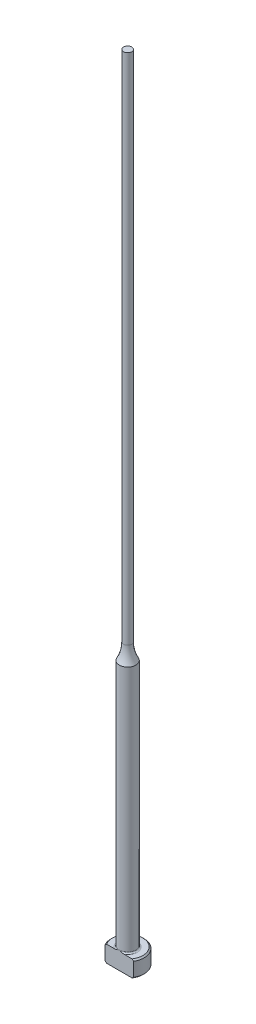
from build123d import *

# Parameters (mm, degrees)
CHAMFER1_SIZE = 0.254
FILLET1_R     = 0.254
KEY_DEPTH     = 153.466131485


with BuildPart() as part:
    # Sketch1 → Revolve1 (revolve)
    with BuildSketch(Plane.XY, mode=Mode.PRIVATE) as revolve1_sk:
        with BuildLine():
            Line((0, 0), (-3.175, 0))
            Line((-3.175, 0), (-3.175, 3.175))
            Line((-3.175, 3.175), (-1.5875, 3.175))
            Line((-1.5875, 3.175), (-1.5875, 50.8))
            ThreePointArc((-1.5875, 50.8), (-0.995388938, 52.286680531), (-0.79375, 53.874180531))
            Line((-0.79375, 53.874180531), (-0.79375, 152.4))
            Line((-0.79375, 152.4), (0, 152.4))
            Line((0, 152.4), (0, 0))
        make_face()
    revolve(revolve1_sk.sketch.rotate(Axis((0, 259.958771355, 0), (0, -1, 0)), 270), axis=Axis((0, 259.958771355, 0), (0, -1, 0)))

    # Chamfer1
    chamfer1_edges = [part.edges().sort_by_distance(p)[0] for p in [
        (0, 0, -3.175),
        (0, 3.175, -3.175),
    ]]
    chamfer(chamfer1_edges, length=CHAMFER1_SIZE)

    # Fillet1
    fillet1_edges = [part.edges().sort_by_distance(p)[0] for p in [
        (0, 3.175, -1.5875),
    ]]
    fillet(fillet1_edges, radius=FILLET1_R)

    # Sketch2 → KEY (cut, through all)
    with BuildSketch(Plane.XZ):
        with BuildLine():
            Line((-2.749630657, 1.5875), (2.749630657, 1.5875))
            ThreePointArc((2.749630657, 1.5875), (0, 3.175), (-2.749630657, 1.5875))
        make_face()
    extrude(amount=-KEY_DEPTH, mode=Mode.SUBTRACT)


solid = part.part
